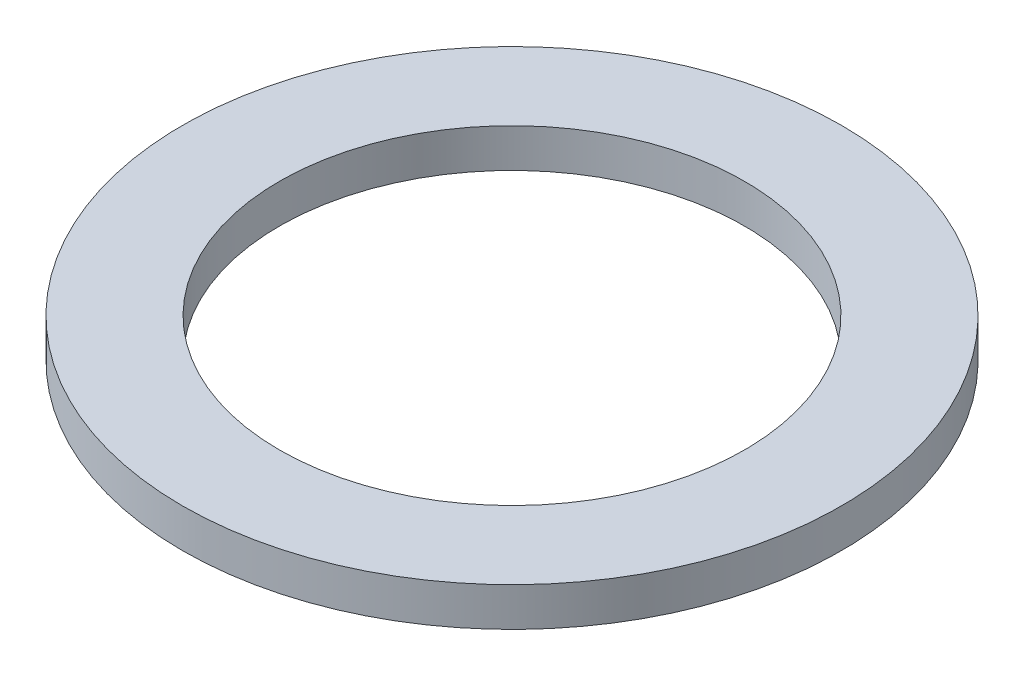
from build123d import *

# Parameters (mm, degrees)
ESQUISSE1_R          = 4.25
ESQUISSE1_R_2        = 3
BASE_EXTRUSION_DEPTH = 0.5


with BuildPart() as part:
    # Esquisse1 → Base-Extrusion (new body)
    with BuildSketch(Plane(origin=(0, 0, 0), x_dir=(1, 0, 0), z_dir=(0, 1, 0))):
        with Locations(Location((0, 0, 0), (0, 0, 270))):
            Circle(ESQUISSE1_R)
        with Locations(Location((0, 0, 0), (0, 0, 270))):
            Circle(ESQUISSE1_R_2, mode=Mode.SUBTRACT)
    extrude(amount=BASE_EXTRUSION_DEPTH)


solid = part.part
